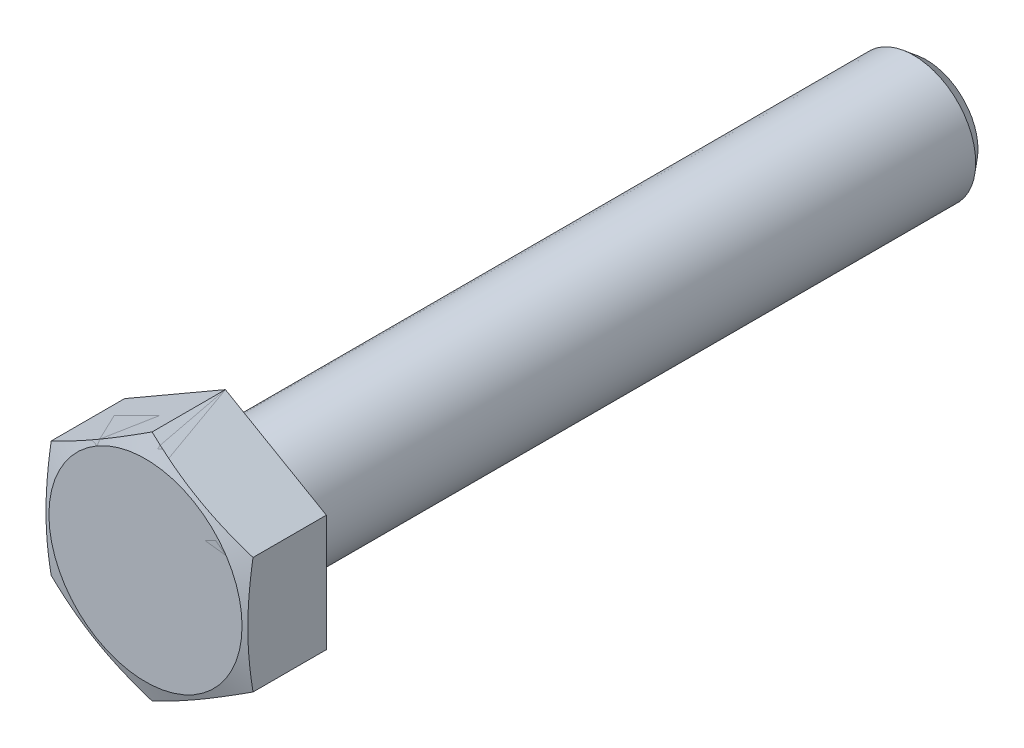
ISO-10303-21;
HEADER;
FILE_DESCRIPTION(('STEP AP214'),'2;1');
FILE_NAME('part.step','',(''),(''),'','','');
FILE_SCHEMA(('AUTOMOTIVE_DESIGN { 1 0 10303 214 1 1 1 1 }'));
ENDSEC;
DATA;
#1=APPLICATION_CONTEXT('core data for automotive mechanical design processes');
#2=APPLICATION_PROTOCOL_DEFINITION('international standard','automotive_design',2000,#1);
#3=PRODUCT_CONTEXT('',#1,'mechanical');
#4=PRODUCT('Part','Part','',(#3));
#5=PRODUCT_RELATED_PRODUCT_CATEGORY('part','',(#4));
#6=PRODUCT_DEFINITION_FORMATION('','',#4);
#7=PRODUCT_DEFINITION_CONTEXT('part definition',#1,'design');
#8=PRODUCT_DEFINITION('design','',#6,#7);
#9=PRODUCT_DEFINITION_SHAPE('','',#8);
#10=(LENGTH_UNIT() NAMED_UNIT(*) SI_UNIT(.MILLI.,.METRE.));
#11=(NAMED_UNIT(*) PLANE_ANGLE_UNIT() SI_UNIT($,.RADIAN.));
#12=(NAMED_UNIT(*) SI_UNIT($,.STERADIAN.) SOLID_ANGLE_UNIT());
#13=UNCERTAINTY_MEASURE_WITH_UNIT(LENGTH_MEASURE(1.E-05),#10,'distance_accuracy_value','');
#14=(GEOMETRIC_REPRESENTATION_CONTEXT(3) GLOBAL_UNCERTAINTY_ASSIGNED_CONTEXT((#13)) GLOBAL_UNIT_ASSIGNED_CONTEXT((#10,
#11,#12)) REPRESENTATION_CONTEXT('',''));
#15=CARTESIAN_POINT('',(0.,0.,0.));
#16=DIRECTION('',(0.,0.,1.));
#17=DIRECTION('',(1.,0.,0.));
#18=AXIS2_PLACEMENT_3D('',#15,#16,#17);
#19=CARTESIAN_POINT('',(0.,0.,0.15));
#20=DIRECTION('',(0.,0.,1.));
#21=DIRECTION('',(1.,0.,0.));
#22=AXIS2_PLACEMENT_3D('',#19,#20,#21);
#23=TOROIDAL_SURFACE('',#22,5.65,0.15);
#24=CARTESIAN_POINT('',(0.,0.,0.15));
#25=DIRECTION('',(0.,0.,1.));
#26=DIRECTION('',(1.,0.,0.));
#27=AXIS2_PLACEMENT_3D('',#24,#25,#26);
#28=CIRCLE('',#27,5.8);
#29=CARTESIAN_POINT('',(5.8,0.,0.15));
#30=VERTEX_POINT('',#29);
#31=EDGE_CURVE('P0_E11',#30,#30,#28,.T.);
#32=ORIENTED_EDGE('',*,*,#31,.F.);
#33=EDGE_LOOP('',(#32));
#34=FACE_BOUND('',#33,.T.);
#35=CARTESIAN_POINT('',(0.,0.,0.));
#36=DIRECTION('',(0.,0.,1.));
#37=DIRECTION('',(1.,0.,0.));
#38=AXIS2_PLACEMENT_3D('',#35,#36,#37);
#39=CIRCLE('',#38,5.65);
#40=CARTESIAN_POINT('',(5.65,0.,0.));
#41=VERTEX_POINT('',#40);
#42=EDGE_CURVE('P0_E33',#41,#41,#39,.T.);
#43=ORIENTED_EDGE('',*,*,#42,.T.);
#44=EDGE_LOOP('',(#43));
#45=FACE_BOUND('',#44,.T.);
#46=ADVANCED_FACE('P0_F26',(#34,#45),#23,.T.);
#47=CARTESIAN_POINT('',(0.,5.65,0.));
#48=DIRECTION('',(0.,0.,-1.));
#49=DIRECTION('',(-1.,0.,0.));
#50=AXIS2_PLACEMENT_3D('',#47,#48,#49);
#51=PLANE('',#50);
#52=CARTESIAN_POINT('',(0.,0.,0.));
#53=DIRECTION('',(0.,0.,1.));
#54=DIRECTION('',(1.,0.,0.));
#55=AXIS2_PLACEMENT_3D('',#52,#53,#54);
#56=CIRCLE('',#55,4.4);
#57=CARTESIAN_POINT('',(4.4,0.,0.));
#58=VERTEX_POINT('',#57);
#59=EDGE_CURVE('P0_E118',#58,#58,#56,.T.);
#60=ORIENTED_EDGE('',*,*,#59,.T.);
#61=EDGE_LOOP('',(#60));
#62=FACE_BOUND('',#61,.T.);
#63=ORIENTED_EDGE('',*,*,#42,.F.);
#64=EDGE_LOOP('',(#63));
#65=FACE_BOUND('',#64,.T.);
#66=ADVANCED_FACE('P0_F124',(#62,#65),#51,.T.);
#67=CARTESIAN_POINT('',(0.,0.,-0.4));
#68=DIRECTION('',(0.,0.,1.));
#69=DIRECTION('',(1.,0.,0.));
#70=AXIS2_PLACEMENT_3D('',#67,#68,#69);
#71=TOROIDAL_SURFACE('',#70,4.4,0.4);
#72=CARTESIAN_POINT('',(0.,0.,-0.4));
#73=DIRECTION('',(0.,0.,1.));
#74=DIRECTION('',(1.,0.,0.));
#75=AXIS2_PLACEMENT_3D('',#72,#73,#74);
#76=CIRCLE('',#75,4.);
#77=CARTESIAN_POINT('',(4.,0.,-0.4));
#78=VERTEX_POINT('',#77);
#79=EDGE_CURVE('P0_E115',#78,#78,#76,.T.);
#80=ORIENTED_EDGE('',*,*,#79,.T.);
#81=EDGE_LOOP('',(#80));
#82=FACE_BOUND('',#81,.T.);
#83=ORIENTED_EDGE('',*,*,#59,.F.);
#84=EDGE_LOOP('',(#83));
#85=FACE_BOUND('',#84,.T.);
#86=ADVANCED_FACE('P0_F126',(#82,#85),#71,.F.);
#87=CARTESIAN_POINT('',(-6.5,-3.752775,0.15));
#88=DIRECTION('',(0.,0.,-1.));
#89=DIRECTION('',(-1.,0.,0.));
#90=AXIS2_PLACEMENT_3D('',#87,#88,#89);
#91=PLANE('',#90);
#92=DIRECTION('',(0.,-1.,0.));
#93=VECTOR('',#92,1.);
#94=CARTESIAN_POINT('',(-6.5,3.752775,0.15));
#95=LINE('',#94,#93);
#96=CARTESIAN_POINT('',(-6.5,3.752775,0.15));
#97=VERTEX_POINT('',#96);
#98=CARTESIAN_POINT('',(-6.5,-3.752775,0.15));
#99=VERTEX_POINT('',#98);
#100=EDGE_CURVE('P0_E92',#97,#99,#95,.T.);
#101=ORIENTED_EDGE('',*,*,#100,.F.);
#102=DIRECTION('',(0.866025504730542,0.499999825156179,0.));
#103=VECTOR('',#102,1.);
#104=CARTESIAN_POINT('',(-6.5,3.752775,0.15));
#105=LINE('',#104,#103);
#106=CARTESIAN_POINT('',(0.,7.50555,0.15));
#107=VERTEX_POINT('',#106);
#108=EDGE_CURVE('P0_E97',#97,#107,#105,.T.);
#109=ORIENTED_EDGE('',*,*,#108,.T.);
#110=DIRECTION('',(0.866025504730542,-0.499999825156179,0.));
#111=VECTOR('',#110,1.);
#112=CARTESIAN_POINT('',(0.,7.50555,0.15));
#113=LINE('',#112,#111);
#114=CARTESIAN_POINT('',(6.5,3.752775,0.15));
#115=VERTEX_POINT('',#114);
#116=EDGE_CURVE('P0_E103',#107,#115,#113,.T.);
#117=ORIENTED_EDGE('',*,*,#116,.T.);
#118=DIRECTION('',(0.,-1.,0.));
#119=VECTOR('',#118,1.);
#120=CARTESIAN_POINT('',(6.5,3.752775,0.15));
#121=LINE('',#120,#119);
#122=CARTESIAN_POINT('',(6.5,-3.752775,0.15));
#123=VERTEX_POINT('',#122);
#124=EDGE_CURVE('P0_E233',#115,#123,#121,.T.);
#125=ORIENTED_EDGE('',*,*,#124,.T.);
#126=DIRECTION('',(-0.866025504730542,-0.499999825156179,0.));
#127=VECTOR('',#126,1.);
#128=CARTESIAN_POINT('',(6.5,-3.752775,0.15));
#129=LINE('',#128,#127);
#130=CARTESIAN_POINT('',(0.,-7.50555,0.15));
#131=VERTEX_POINT('',#130);
#132=EDGE_CURVE('P0_E219',#123,#131,#129,.T.);
#133=ORIENTED_EDGE('',*,*,#132,.T.);
#134=DIRECTION('',(-0.866025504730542,0.499999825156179,0.));
#135=VECTOR('',#134,1.);
#136=CARTESIAN_POINT('',(0.,-7.50555,0.15));
#137=LINE('',#136,#135);
#138=EDGE_CURVE('P0_E217',#131,#99,#137,.T.);
#139=ORIENTED_EDGE('',*,*,#138,.T.);
#140=EDGE_LOOP('',(#101,#109,#117,#125,#133,#139));
#141=FACE_BOUND('',#140,.T.);
#142=ORIENTED_EDGE('',*,*,#31,.T.);
#143=EDGE_LOOP('',(#142));
#144=FACE_BOUND('',#143,.T.);
#145=ADVANCED_FACE('P0_F132',(#141,#144),#91,.T.);
#146=CARTESIAN_POINT('',(-6.5,3.752775,0.15));
#147=DIRECTION('',(-1.,0.,0.));
#148=DIRECTION('',(0.,0.,1.));
#149=AXIS2_PLACEMENT_3D('',#146,#147,#148);
#150=PLANE('',#149);
#151=CARTESIAN_POINT('',(-6.5,-9.92768465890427,3.42219076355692));
#152=CARTESIAN_POINT('',(-6.5,-9.63320200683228,3.50410507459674));
#153=CARTESIAN_POINT('',(-6.5,-9.33844353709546,3.58504584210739));
#154=CARTESIAN_POINT('',(-6.5,-8.74823643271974,3.74444577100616));
#155=CARTESIAN_POINT('',(-6.5,-8.45278775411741,3.82290476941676));
#156=CARTESIAN_POINT('',(-6.5,-7.86064924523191,3.97691306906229));
#157=CARTESIAN_POINT('',(-6.5,-7.56395820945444,4.05245775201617));
#158=CARTESIAN_POINT('',(-6.5,-6.96964246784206,4.19977756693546));
#159=CARTESIAN_POINT('',(-6.5,-6.67201777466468,4.27155274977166));
#160=CARTESIAN_POINT('',(-6.5,-6.07920080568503,4.40958972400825));
#161=CARTESIAN_POINT('',(-6.5,-5.78402145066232,4.47590673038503));
#162=CARTESIAN_POINT('',(-6.5,-5.19244039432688,4.60283348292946));
#163=CARTESIAN_POINT('',(-6.5,-4.89603873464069,4.66344342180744));
#164=CARTESIAN_POINT('',(-6.5,-4.30192301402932,4.77756540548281));
#165=CARTESIAN_POINT('',(-6.5,-4.00420923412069,4.83107890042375));
#166=CARTESIAN_POINT('',(-6.5,-3.4073313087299,4.92939310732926));
#167=CARTESIAN_POINT('',(-6.5,-3.10816717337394,4.9741938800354));
#168=CARTESIAN_POINT('',(-6.5,-2.51584786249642,5.05231938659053));
#169=CARTESIAN_POINT('',(-6.5,-2.22272695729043,5.08590043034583));
#170=CARTESIAN_POINT('',(-6.5,-1.6353790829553,5.14147194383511));
#171=CARTESIAN_POINT('',(-6.5,-1.34115215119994,5.16346280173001));
#172=CARTESIAN_POINT('',(-6.5,-0.752211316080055,5.19459534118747));
#173=CARTESIAN_POINT('',(-6.5,-0.457497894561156,5.20374596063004));
#174=CARTESIAN_POINT('',(-6.5,0.132041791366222,5.20865235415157));
#175=CARTESIAN_POINT('',(-6.5,0.426868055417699,5.20440817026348));
#176=CARTESIAN_POINT('',(-6.5,1.01755930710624,5.18273935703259));
#177=CARTESIAN_POINT('',(-6.5,1.31342173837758,5.16524639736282));
#178=CARTESIAN_POINT('',(-6.5,1.90416213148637,5.11804868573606));
#179=CARTESIAN_POINT('',(-6.5,2.19904006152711,5.08834354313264));
#180=CARTESIAN_POINT('',(-6.5,2.78778899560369,5.01822295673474));
#181=CARTESIAN_POINT('',(-6.5,3.08165875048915,4.97779718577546));
#182=CARTESIAN_POINT('',(-6.5,3.66800309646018,4.88794282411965));
#183=CARTESIAN_POINT('',(-6.5,3.96047768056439,4.83851418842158));
#184=CARTESIAN_POINT('',(-6.5,4.53383951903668,4.734123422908));
#185=CARTESIAN_POINT('',(-6.5,4.81477360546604,4.67941596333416));
#186=CARTESIAN_POINT('',(-6.5,5.37549299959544,4.56437238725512));
#187=CARTESIAN_POINT('',(-6.5,5.65527825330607,4.50403600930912));
#188=CARTESIAN_POINT('',(-6.5,6.21386077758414,4.3787797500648));
#189=CARTESIAN_POINT('',(-6.5,6.49265788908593,4.31385916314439));
#190=CARTESIAN_POINT('',(-6.5,7.0493618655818,4.18029589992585));
#191=CARTESIAN_POINT('',(-6.5,7.3272687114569,4.11165314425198));
#192=CARTESIAN_POINT('',(-6.5,7.88244293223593,3.97129958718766));
#193=CARTESIAN_POINT('',(-6.5,8.159709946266,3.89958736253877));
#194=CARTESIAN_POINT('',(-6.5,8.71358713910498,3.75366585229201));
#195=CARTESIAN_POINT('',(-6.5,8.99019731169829,3.67945654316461));
#196=CARTESIAN_POINT('',(-6.5,9.81912857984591,3.45377511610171));
#197=CARTESIAN_POINT('',(-6.5,10.3706135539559,3.29923331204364));
#198=CARTESIAN_POINT('',(-6.5,11.4645427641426,2.98659237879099));
#199=CARTESIAN_POINT('',(-6.5,12.0070088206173,2.82856906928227));
#200=CARTESIAN_POINT('',(-6.5,13.090775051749,2.5085206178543));
#201=CARTESIAN_POINT('',(-6.5,13.6320751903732,2.34649535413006));
#202=CARTESIAN_POINT('',(-6.5,14.7126438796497,2.01984553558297));
#203=CARTESIAN_POINT('',(-6.5,15.2519143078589,1.85522717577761));
#204=CARTESIAN_POINT('',(-6.5,16.3297306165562,1.52373570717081));
#205=CARTESIAN_POINT('',(-6.5,16.8682765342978,1.3568627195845));
#206=CARTESIAN_POINT('',(-6.5,17.4065709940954,1.18919184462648));
#207=B_SPLINE_CURVE_WITH_KNOTS('',3,(#151,#152,#153,#154,#155,#156,#157,#158,#159,#160,#161,
#162,#163,#164,#165,#166,#167,#168,#169,#170,#171,#172,#173,#174,#175,#176,#177,#178,#179,#180,
#181,#182,#183,#184,#185,#186,#187,#188,#189,#190,#191,#192,#193,#194,#195,#196,#197,#198,#199,
#200,#201,#202,#203,#204,#205,#206),.UNSPECIFIED.,.F.,.F.,(4,2,2,2,2,2,2,2,2,2,2,2,2,2,2,2,2,2,
2,2,2,2,2,2,2,2,2,4),(0.,0.916995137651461,1.83405036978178,2.75250368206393,3.67094459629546,
4.57851158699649,5.48604792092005,6.39339851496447,7.30074278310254,8.18565759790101,
9.07054277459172,9.95481169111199,10.8390778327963,11.7279358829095,12.616822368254,
13.5065682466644,14.3963185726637,15.2548833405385,16.1134880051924,16.9722251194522,
17.830980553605,18.6901385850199,19.5493047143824,21.2674414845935,22.9624656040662,
24.6575413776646,26.3490461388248,28.0404603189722),.UNSPECIFIED.);
#208=CARTESIAN_POINT('',(-6.5,3.752775,4.87245657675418));
#209=VERTEX_POINT('',#208);
#210=CARTESIAN_POINT('',(-6.5,-3.752775,4.87245657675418));
#211=VERTEX_POINT('',#210);
#212=EDGE_CURVE('P0_E81',#209,#211,#207,.F.);
#213=ORIENTED_EDGE('',*,*,#212,.F.);
#214=DIRECTION('',(0.,0.,1.));
#215=VECTOR('',#214,1.);
#216=CARTESIAN_POINT('',(-6.5,3.752775,0.15));
#217=LINE('',#216,#215);
#218=EDGE_CURVE('P0_E90',#97,#209,#217,.T.);
#219=ORIENTED_EDGE('',*,*,#218,.F.);
#220=ORIENTED_EDGE('',*,*,#100,.T.);
#221=DIRECTION('',(0.,0.,1.));
#222=VECTOR('',#221,1.);
#223=CARTESIAN_POINT('',(-6.5,-3.752775,0.15));
#224=LINE('',#223,#222);
#225=EDGE_CURVE('P0_E48',#99,#211,#224,.T.);
#226=ORIENTED_EDGE('',*,*,#225,.T.);
#227=EDGE_LOOP('',(#213,#219,#220,#226));
#228=FACE_BOUND('',#227,.T.);
#229=ADVANCED_FACE('P0_F88',(#228),#150,.T.);
#230=CARTESIAN_POINT('',(0.,-7.50555,0.15));
#231=DIRECTION('',(0.499999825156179,0.866025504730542,0.));
#232=DIRECTION('',(0.866025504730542,-0.499999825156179,0.));
#233=AXIS2_PLACEMENT_3D('',#230,#231,#232);
#234=PLANE('',#233);
#235=DIRECTION('',(0.,0.,1.));
#236=VECTOR('',#235,1.);
#237=CARTESIAN_POINT('',(0.,-7.50555,0.15));
#238=LINE('',#237,#236);
#239=CARTESIAN_POINT('',(0.,-7.50555,4.87245744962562));
#240=VERTEX_POINT('',#239);
#241=EDGE_CURVE('P0_E224',#131,#240,#238,.T.);
#242=ORIENTED_EDGE('',*,*,#241,.T.);
#243=CARTESIAN_POINT('',(2.00000000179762E-07,-7.50555011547,4.87245741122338));
#244=CARTESIAN_POINT('',(-0.269447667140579,-7.34998438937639,4.92421240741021));
#245=CARTESIAN_POINT('',(-0.539641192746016,-7.19398815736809,4.97125826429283));
#246=CARTESIAN_POINT('',(-1.08149605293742,-6.88114825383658,5.05398662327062));
#247=CARTESIAN_POINT('',(-1.35315821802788,-6.7243041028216,5.0896618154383));
#248=CARTESIAN_POINT('',(-1.89542621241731,-6.41122567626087,5.14740289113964));
#249=CARTESIAN_POINT('',(-2.16602338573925,-6.25499639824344,5.16957424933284));
#250=CARTESIAN_POINT('',(-2.7077471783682,-5.94223216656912,5.19930920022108));
#251=CARTESIAN_POINT('',(-2.97887360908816,-5.78569732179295,5.20687728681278));
#252=CARTESIAN_POINT('',(-3.52112646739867,-5.47262763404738,5.2068772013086));
#253=CARTESIAN_POINT('',(-3.79225289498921,-5.31609279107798,5.19930902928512));
#254=CARTESIAN_POINT('',(-4.33397667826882,-5.00332856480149,5.16957391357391));
#255=CARTESIAN_POINT('',(-4.60457384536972,-4.84709929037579,5.14740247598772));
#256=CARTESIAN_POINT('',(-5.14684182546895,-4.5340208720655,5.08966125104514));
#257=CARTESIAN_POINT('',(-5.41850398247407,-4.37717672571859,5.05398598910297));
#258=CARTESIAN_POINT('',(-5.96035882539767,-4.06433683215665,4.97125750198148));
#259=CARTESIAN_POINT('',(-6.23055234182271,-3.90834060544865,4.92421158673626));
#260=CARTESIAN_POINT('',(-6.5000002,-3.75277488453,4.87245653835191));
#261=B_SPLINE_CURVE_WITH_KNOTS('',3,(#243,#244,#245,#246,#247,#248,#249,#250,#251,#252,#253,
#254,#255,#256,#257,#258,#259,#260),.UNSPECIFIED.,.F.,.F.,(4,2,2,2,2,2,2,2,4),(0.,
0.946299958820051,1.89320704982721,2.83261995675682,3.7717437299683,4.71086749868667,
5.65028040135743,6.59718748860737,7.54348744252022),.UNSPECIFIED.);
#262=EDGE_CURVE('P0_E93',#240,#211,#261,.T.);
#263=ORIENTED_EDGE('',*,*,#262,.T.);
#264=ORIENTED_EDGE('',*,*,#225,.F.);
#265=ORIENTED_EDGE('',*,*,#138,.F.);
#266=EDGE_LOOP('',(#242,#263,#264,#265));
#267=FACE_BOUND('',#266,.T.);
#268=ADVANCED_FACE('P0_F153',(#267),#234,.F.);
#269=CARTESIAN_POINT('',(6.5,-3.752775,0.15));
#270=DIRECTION('',(-0.499999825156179,0.866025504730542,0.));
#271=DIRECTION('',(0.866025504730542,0.499999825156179,0.));
#272=AXIS2_PLACEMENT_3D('',#269,#270,#271);
#273=PLANE('',#272);
#274=DIRECTION('',(0.,0.,1.));
#275=VECTOR('',#274,1.);
#276=CARTESIAN_POINT('',(6.5,-3.752775,0.15));
#277=LINE('',#276,#275);
#278=CARTESIAN_POINT('',(6.5,-3.752775,4.87245657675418));
#279=VERTEX_POINT('',#278);
#280=EDGE_CURVE('P0_E227',#123,#279,#277,.T.);
#281=ORIENTED_EDGE('',*,*,#280,.T.);
#282=CARTESIAN_POINT('',(6.5000002,-3.75277488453,4.87245653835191));
#283=CARTESIAN_POINT('',(6.23055234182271,-3.90834060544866,4.92421158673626));
#284=CARTESIAN_POINT('',(5.96035882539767,-4.06433683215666,4.97125750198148));
#285=CARTESIAN_POINT('',(5.41850398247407,-4.37717672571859,5.05398598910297));
#286=CARTESIAN_POINT('',(5.14684182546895,-4.5340208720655,5.08966125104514));
#287=CARTESIAN_POINT('',(4.60457384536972,-4.84709929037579,5.14740247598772));
#288=CARTESIAN_POINT('',(4.33397667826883,-5.00332856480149,5.16957391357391));
#289=CARTESIAN_POINT('',(3.79225289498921,-5.31609279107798,5.19930902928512));
#290=CARTESIAN_POINT('',(3.52112646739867,-5.47262763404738,5.20687720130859));
#291=CARTESIAN_POINT('',(2.97887360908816,-5.78569732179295,5.20687728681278));
#292=CARTESIAN_POINT('',(2.7077471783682,-5.94223216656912,5.19930920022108));
#293=CARTESIAN_POINT('',(2.16602338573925,-6.25499639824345,5.16957424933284));
#294=CARTESIAN_POINT('',(1.89542621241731,-6.41122567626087,5.14740289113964));
#295=CARTESIAN_POINT('',(1.35315821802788,-6.72430410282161,5.0896618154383));
#296=CARTESIAN_POINT('',(1.08149605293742,-6.88114825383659,5.05398662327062));
#297=CARTESIAN_POINT('',(0.539641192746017,-7.19398815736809,4.97125826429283));
#298=CARTESIAN_POINT('',(0.269447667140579,-7.34998438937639,4.92421240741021));
#299=CARTESIAN_POINT('',(-2.00000001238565E-07,-7.50555011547,4.87245741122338));
#300=B_SPLINE_CURVE_WITH_KNOTS('',3,(#282,#283,#284,#285,#286,#287,#288,#289,#290,#291,#292,
#293,#294,#295,#296,#297,#298,#299),.UNSPECIFIED.,.F.,.F.,(4,2,2,2,2,2,2,2,4),(0.,
0.94629995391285,1.89320704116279,2.83261994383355,3.77174371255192,4.7108674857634,
5.65028039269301,6.59718748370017,7.54348744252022),.UNSPECIFIED.);
#301=EDGE_CURVE('P0_E190',#279,#240,#300,.T.);
#302=ORIENTED_EDGE('',*,*,#301,.T.);
#303=ORIENTED_EDGE('',*,*,#241,.F.);
#304=ORIENTED_EDGE('',*,*,#132,.F.);
#305=EDGE_LOOP('',(#281,#302,#303,#304));
#306=FACE_BOUND('',#305,.T.);
#307=ADVANCED_FACE('P0_F195',(#306),#273,.F.);
#308=CARTESIAN_POINT('',(6.5,3.752775,0.15));
#309=DIRECTION('',(-1.,0.,0.));
#310=DIRECTION('',(0.,0.,1.));
#311=AXIS2_PLACEMENT_3D('',#308,#309,#310);
#312=PLANE('',#311);
#313=DIRECTION('',(0.,0.,1.));
#314=VECTOR('',#313,1.);
#315=CARTESIAN_POINT('',(6.5,3.752775,0.15));
#316=LINE('',#315,#314);
#317=CARTESIAN_POINT('',(6.5,3.752775,4.87245657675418));
#318=VERTEX_POINT('',#317);
#319=EDGE_CURVE('P0_E101',#115,#318,#316,.T.);
#320=ORIENTED_EDGE('',*,*,#319,.T.);
#321=CARTESIAN_POINT('',(6.5,-9.92768465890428,3.42219076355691));
#322=CARTESIAN_POINT('',(6.5,-9.63320200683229,3.50410507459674));
#323=CARTESIAN_POINT('',(6.5,-9.33844353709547,3.58504584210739));
#324=CARTESIAN_POINT('',(6.5,-8.74823643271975,3.74444577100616));
#325=CARTESIAN_POINT('',(6.5,-8.45278775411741,3.82290476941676));
#326=CARTESIAN_POINT('',(6.5,-7.86064924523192,3.97691306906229));
#327=CARTESIAN_POINT('',(6.5,-7.56395820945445,4.05245775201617));
#328=CARTESIAN_POINT('',(6.5,-6.96964246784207,4.19977756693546));
#329=CARTESIAN_POINT('',(6.5,-6.67201777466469,4.27155274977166));
#330=CARTESIAN_POINT('',(6.5,-6.07920080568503,4.40958972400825));
#331=CARTESIAN_POINT('',(6.5,-5.78402145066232,4.47590673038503));
#332=CARTESIAN_POINT('',(6.5,-5.19244039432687,4.60283348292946));
#333=CARTESIAN_POINT('',(6.5,-4.89603873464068,4.66344342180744));
#334=CARTESIAN_POINT('',(6.5,-4.30192301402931,4.77756540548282));
#335=CARTESIAN_POINT('',(6.5,-4.00420923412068,4.83107890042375));
#336=CARTESIAN_POINT('',(6.5,-3.4073313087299,4.92939310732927));
#337=CARTESIAN_POINT('',(6.5,-3.10816717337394,4.97419388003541));
#338=CARTESIAN_POINT('',(6.5,-2.51584786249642,5.05231938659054));
#339=CARTESIAN_POINT('',(6.5,-2.22272695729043,5.08590043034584));
#340=CARTESIAN_POINT('',(6.5,-1.6353790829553,5.14147194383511));
#341=CARTESIAN_POINT('',(6.5,-1.34115215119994,5.16346280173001));
#342=CARTESIAN_POINT('',(6.5,-0.752211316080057,5.19459534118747));
#343=CARTESIAN_POINT('',(6.5,-0.457497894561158,5.20374596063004));
#344=CARTESIAN_POINT('',(6.5,0.132041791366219,5.20865235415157));
#345=CARTESIAN_POINT('',(6.5,0.426868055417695,5.20440817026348));
#346=CARTESIAN_POINT('',(6.5,1.01755930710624,5.18273935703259));
#347=CARTESIAN_POINT('',(6.5,1.31342173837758,5.16524639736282));
#348=CARTESIAN_POINT('',(6.5,1.90416213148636,5.11804868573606));
#349=CARTESIAN_POINT('',(6.5,2.19904006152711,5.08834354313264));
#350=CARTESIAN_POINT('',(6.5,2.78778899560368,5.01822295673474));
#351=CARTESIAN_POINT('',(6.5,3.08165875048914,4.97779718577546));
#352=CARTESIAN_POINT('',(6.5,3.66800309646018,4.88794282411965));
#353=CARTESIAN_POINT('',(6.5,3.96047768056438,4.83851418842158));
#354=CARTESIAN_POINT('',(6.5,4.53383951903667,4.734123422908));
#355=CARTESIAN_POINT('',(6.5,4.81477360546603,4.67941596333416));
#356=CARTESIAN_POINT('',(6.5,5.37549299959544,4.56437238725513));
#357=CARTESIAN_POINT('',(6.5,5.65527825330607,4.50403600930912));
#358=CARTESIAN_POINT('',(6.5,6.21386077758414,4.3787797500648));
#359=CARTESIAN_POINT('',(6.5,6.49265788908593,4.31385916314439));
#360=CARTESIAN_POINT('',(6.5,7.0493618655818,4.18029589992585));
#361=CARTESIAN_POINT('',(6.5,7.3272687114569,4.11165314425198));
#362=CARTESIAN_POINT('',(6.5,7.88244293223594,3.97129958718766));
#363=CARTESIAN_POINT('',(6.5,8.15970994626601,3.89958736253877));
#364=CARTESIAN_POINT('',(6.5,8.71358713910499,3.75366585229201));
#365=CARTESIAN_POINT('',(6.5,8.9901973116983,3.67945654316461));
#366=CARTESIAN_POINT('',(6.5,9.81912857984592,3.45377511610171));
#367=CARTESIAN_POINT('',(6.5,10.3706135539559,3.29923331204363));
#368=CARTESIAN_POINT('',(6.5,11.4645427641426,2.98659237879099));
#369=CARTESIAN_POINT('',(6.5,12.0070088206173,2.82856906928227));
#370=CARTESIAN_POINT('',(6.5,13.090775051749,2.5085206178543));
#371=CARTESIAN_POINT('',(6.5,13.6320751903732,2.34649535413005));
#372=CARTESIAN_POINT('',(6.5,14.7126438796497,2.01984553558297));
#373=CARTESIAN_POINT('',(6.5,15.2519143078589,1.85522717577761));
#374=CARTESIAN_POINT('',(6.5,16.3297306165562,1.52373570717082));
#375=CARTESIAN_POINT('',(6.5,16.8682765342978,1.3568627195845));
#376=CARTESIAN_POINT('',(6.5,17.4065709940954,1.18919184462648));
#377=B_SPLINE_CURVE_WITH_KNOTS('',3,(#321,#322,#323,#324,#325,#326,#327,#328,#329,#330,#331,
#332,#333,#334,#335,#336,#337,#338,#339,#340,#341,#342,#343,#344,#345,#346,#347,#348,#349,#350,
#351,#352,#353,#354,#355,#356,#357,#358,#359,#360,#361,#362,#363,#364,#365,#366,#367,#368,#369,
#370,#371,#372,#373,#374,#375,#376),.UNSPECIFIED.,.F.,.F.,(4,2,2,2,2,2,2,2,2,2,2,2,2,2,2,2,2,2,
2,2,2,2,2,2,2,2,2,4),(0.,0.916995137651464,1.83405036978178,2.75250368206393,3.67094459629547,
4.57851158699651,5.48604792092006,6.39339851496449,7.30074278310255,8.18565759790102,
9.07054277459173,9.954811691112,10.8390778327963,11.7279358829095,12.616822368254,
13.5065682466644,14.3963185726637,15.2548833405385,16.1134880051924,16.9722251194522,
17.830980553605,18.6901385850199,19.5493047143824,21.2674414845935,22.9624656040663,
24.6575413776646,26.3490461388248,28.0404603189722),.UNSPECIFIED.);
#378=EDGE_CURVE('P0_E185',#318,#279,#377,.F.);
#379=ORIENTED_EDGE('',*,*,#378,.T.);
#380=ORIENTED_EDGE('',*,*,#280,.F.);
#381=ORIENTED_EDGE('',*,*,#124,.F.);
#382=EDGE_LOOP('',(#320,#379,#380,#381));
#383=FACE_BOUND('',#382,.T.);
#384=ADVANCED_FACE('P0_F198',(#383),#312,.F.);
#385=CARTESIAN_POINT('',(0.,7.50555,0.15));
#386=DIRECTION('',(-0.499999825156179,-0.866025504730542,0.));
#387=DIRECTION('',(-0.866025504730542,0.499999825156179,0.));
#388=AXIS2_PLACEMENT_3D('',#385,#386,#387);
#389=PLANE('',#388);
#390=DIRECTION('',(0.,0.,1.));
#391=VECTOR('',#390,1.);
#392=CARTESIAN_POINT('',(0.,7.50555,0.15));
#393=LINE('',#392,#391);
#394=CARTESIAN_POINT('',(0.,7.50555,4.87245744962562));
#395=VERTEX_POINT('',#394);
#396=EDGE_CURVE('P0_E99',#107,#395,#393,.T.);
#397=ORIENTED_EDGE('',*,*,#396,.T.);
#398=CARTESIAN_POINT('',(-1.99999999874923E-07,7.50555011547,4.87245741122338));
#399=CARTESIAN_POINT('',(0.269447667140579,7.34998438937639,4.92421240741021));
#400=CARTESIAN_POINT('',(0.539641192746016,7.19398815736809,4.97125826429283));
#401=CARTESIAN_POINT('',(1.08149605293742,6.88114825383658,5.05398662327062));
#402=CARTESIAN_POINT('',(1.35315821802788,6.7243041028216,5.0896618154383));
#403=CARTESIAN_POINT('',(1.89542621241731,6.41122567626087,5.14740289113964));
#404=CARTESIAN_POINT('',(2.16602338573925,6.25499639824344,5.16957424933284));
#405=CARTESIAN_POINT('',(2.7077471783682,5.94223216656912,5.19930920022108));
#406=CARTESIAN_POINT('',(2.97887360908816,5.78569732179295,5.20687728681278));
#407=CARTESIAN_POINT('',(3.52112646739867,5.47262763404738,5.2068772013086));
#408=CARTESIAN_POINT('',(3.79225289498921,5.31609279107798,5.19930902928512));
#409=CARTESIAN_POINT('',(4.33397667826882,5.00332856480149,5.16957391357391));
#410=CARTESIAN_POINT('',(4.60457384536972,4.84709929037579,5.14740247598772));
#411=CARTESIAN_POINT('',(5.14684182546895,4.5340208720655,5.08966125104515));
#412=CARTESIAN_POINT('',(5.41850398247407,4.37717672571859,5.05398598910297));
#413=CARTESIAN_POINT('',(5.96035882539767,4.06433683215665,4.97125750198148));
#414=CARTESIAN_POINT('',(6.23055234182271,3.90834060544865,4.92421158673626));
#415=CARTESIAN_POINT('',(6.5000002,3.75277488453,4.87245653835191));
#416=B_SPLINE_CURVE_WITH_KNOTS('',3,(#398,#399,#400,#401,#402,#403,#404,#405,#406,#407,#408,
#409,#410,#411,#412,#413,#414,#415),.UNSPECIFIED.,.F.,.F.,(4,2,2,2,2,2,2,2,4),(0.,
0.946299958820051,1.89320704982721,2.83261995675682,3.7717437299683,4.71086749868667,
5.65028040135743,6.59718748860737,7.54348744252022),.UNSPECIFIED.);
#417=EDGE_CURVE('P0_E40',#395,#318,#416,.T.);
#418=ORIENTED_EDGE('',*,*,#417,.T.);
#419=ORIENTED_EDGE('',*,*,#319,.F.);
#420=ORIENTED_EDGE('',*,*,#116,.F.);
#421=EDGE_LOOP('',(#397,#418,#419,#420));
#422=FACE_BOUND('',#421,.T.);
#423=ADVANCED_FACE('P0_F202',(#422),#389,.F.);
#424=CARTESIAN_POINT('',(-6.5,3.752775,0.15));
#425=DIRECTION('',(0.499999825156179,-0.866025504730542,0.));
#426=DIRECTION('',(-0.866025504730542,-0.499999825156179,0.));
#427=AXIS2_PLACEMENT_3D('',#424,#425,#426);
#428=PLANE('',#427);
#429=ORIENTED_EDGE('',*,*,#218,.T.);
#430=CARTESIAN_POINT('',(-6.5000002,3.75277488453,4.8724565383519));
#431=CARTESIAN_POINT('',(-6.23055234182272,3.90834060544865,4.92421158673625));
#432=CARTESIAN_POINT('',(-5.96035882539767,4.06433683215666,4.97125750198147));
#433=CARTESIAN_POINT('',(-5.41850398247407,4.37717672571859,5.05398598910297));
#434=CARTESIAN_POINT('',(-5.14684182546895,4.5340208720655,5.08966125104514));
#435=CARTESIAN_POINT('',(-4.60457384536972,4.84709929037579,5.14740247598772));
#436=CARTESIAN_POINT('',(-4.33397667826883,5.00332856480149,5.16957391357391));
#437=CARTESIAN_POINT('',(-3.79225289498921,5.31609279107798,5.19930902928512));
#438=CARTESIAN_POINT('',(-3.52112646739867,5.47262763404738,5.20687720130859));
#439=CARTESIAN_POINT('',(-2.97887360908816,5.78569732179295,5.20687728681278));
#440=CARTESIAN_POINT('',(-2.7077471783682,5.94223216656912,5.19930920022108));
#441=CARTESIAN_POINT('',(-2.16602338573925,6.25499639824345,5.16957424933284));
#442=CARTESIAN_POINT('',(-1.89542621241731,6.41122567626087,5.14740289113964));
#443=CARTESIAN_POINT('',(-1.35315821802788,6.72430410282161,5.0896618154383));
#444=CARTESIAN_POINT('',(-1.08149605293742,6.88114825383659,5.05398662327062));
#445=CARTESIAN_POINT('',(-0.539641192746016,7.19398815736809,4.97125826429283));
#446=CARTESIAN_POINT('',(-0.269447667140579,7.34998438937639,4.92421240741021));
#447=CARTESIAN_POINT('',(2.00000001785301E-07,7.50555011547,4.87245741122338));
#448=B_SPLINE_CURVE_WITH_KNOTS('',3,(#430,#431,#432,#433,#434,#435,#436,#437,#438,#439,#440,
#441,#442,#443,#444,#445,#446,#447),.UNSPECIFIED.,.F.,.F.,(4,2,2,2,2,2,2,2,4),(0.,
0.946299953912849,1.89320704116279,2.83261994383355,3.77174371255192,4.7108674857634,
5.65028039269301,6.59718748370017,7.54348744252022),.UNSPECIFIED.);
#449=EDGE_CURVE('P0_E77',#209,#395,#448,.T.);
#450=ORIENTED_EDGE('',*,*,#449,.T.);
#451=ORIENTED_EDGE('',*,*,#396,.F.);
#452=ORIENTED_EDGE('',*,*,#108,.F.);
#453=EDGE_LOOP('',(#429,#450,#451,#452));
#454=FACE_BOUND('',#453,.T.);
#455=ADVANCED_FACE('P0_F95',(#454),#428,.F.);
#456=CARTESIAN_POINT('',(0.,0.,4.82253454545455));
#457=DIRECTION('',(0.,0.,-1.));
#458=DIRECTION('',(-1.,0.,0.));
#459=AXIS2_PLACEMENT_3D('',#456,#457,#458);
#460=CONICAL_SURFACE('',#459,7.655661,1.24972999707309);
#461=ORIENTED_EDGE('',*,*,#212,.T.);
#462=ORIENTED_EDGE('',*,*,#262,.F.);
#463=ORIENTED_EDGE('',*,*,#301,.F.);
#464=ORIENTED_EDGE('',*,*,#378,.F.);
#465=ORIENTED_EDGE('',*,*,#417,.F.);
#466=ORIENTED_EDGE('',*,*,#449,.F.);
#467=EDGE_LOOP('',(#461,#462,#463,#464,#465,#466));
#468=FACE_BOUND('',#467,.T.);
#469=CARTESIAN_POINT('',(0.,0.,5.3));
#470=DIRECTION('',(0.,0.,-1.));
#471=DIRECTION('',(-1.,0.,0.));
#472=AXIS2_PLACEMENT_3D('',#469,#470,#471);
#473=CIRCLE('',#472,6.21999097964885);
#474=CARTESIAN_POINT('',(-6.21999097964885,0.,5.3));
#475=VERTEX_POINT('',#474);
#476=EDGE_CURVE('P0_E85',#475,#475,#473,.F.);
#477=ORIENTED_EDGE('',*,*,#476,.F.);
#478=EDGE_LOOP('',(#477));
#479=FACE_BOUND('',#478,.T.);
#480=ADVANCED_FACE('P0_F79',(#468,#479),#460,.T.);
#481=CARTESIAN_POINT('',(-6.5,-3.752775,5.3));
#482=DIRECTION('',(0.,0.,-1.));
#483=DIRECTION('',(-1.,0.,0.));
#484=AXIS2_PLACEMENT_3D('',#481,#482,#483);
#485=PLANE('',#484);
#486=ORIENTED_EDGE('',*,*,#476,.T.);
#487=EDGE_LOOP('',(#486));
#488=FACE_BOUND('',#487,.T.);
#489=ADVANCED_FACE('P0_F148',(#488),#485,.F.);
#490=CARTESIAN_POINT('',(0.,3.3234375,-45.));
#491=DIRECTION('',(0.,0.,-1.));
#492=DIRECTION('',(-1.,0.,0.));
#493=AXIS2_PLACEMENT_3D('',#490,#491,#492);
#494=PLANE('',#493);
#495=CARTESIAN_POINT('',(0.,0.,-45.));
#496=DIRECTION('',(0.,0.,1.));
#497=DIRECTION('',(1.,0.,0.));
#498=AXIS2_PLACEMENT_3D('',#495,#496,#497);
#499=CIRCLE('',#498,3.3234375);
#500=CARTESIAN_POINT('',(3.3234375,0.,-45.));
#501=VERTEX_POINT('',#500);
#502=EDGE_CURVE('P0_E109',#501,#501,#499,.T.);
#503=ORIENTED_EDGE('',*,*,#502,.F.);
#504=EDGE_LOOP('',(#503));
#505=FACE_BOUND('',#504,.T.);
#506=ADVANCED_FACE('P0_F144',(#505),#494,.T.);
#507=CARTESIAN_POINT('',(0.,0.,-44.1734375));
#508=DIRECTION('',(0.,0.,1.));
#509=DIRECTION('',(1.,0.,0.));
#510=AXIS2_PLACEMENT_3D('',#507,#508,#509);
#511=CONICAL_SURFACE('',#510,4.,0.68593535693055);
#512=ORIENTED_EDGE('',*,*,#502,.T.);
#513=EDGE_LOOP('',(#512));
#514=FACE_BOUND('',#513,.T.);
#515=CARTESIAN_POINT('',(0.,0.,-44.1734375));
#516=DIRECTION('',(0.,0.,1.));
#517=DIRECTION('',(1.,0.,0.));
#518=AXIS2_PLACEMENT_3D('',#515,#516,#517);
#519=CIRCLE('',#518,4.);
#520=CARTESIAN_POINT('',(4.,0.,-44.1734375));
#521=VERTEX_POINT('',#520);
#522=EDGE_CURVE('P0_E112',#521,#521,#519,.T.);
#523=ORIENTED_EDGE('',*,*,#522,.F.);
#524=EDGE_LOOP('',(#523));
#525=FACE_BOUND('',#524,.T.);
#526=ADVANCED_FACE('P0_F140',(#514,#525),#511,.T.);
#527=CARTESIAN_POINT('',(0.,0.,0.15));
#528=DIRECTION('',(0.,0.,1.));
#529=DIRECTION('',(1.,0.,0.));
#530=AXIS2_PLACEMENT_3D('',#527,#528,#529);
#531=CYLINDRICAL_SURFACE('',#530,4.);
#532=ORIENTED_EDGE('',*,*,#522,.T.);
#533=EDGE_LOOP('',(#532));
#534=FACE_BOUND('',#533,.T.);
#535=ORIENTED_EDGE('',*,*,#79,.F.);
#536=EDGE_LOOP('',(#535));
#537=FACE_BOUND('',#536,.T.);
#538=ADVANCED_FACE('P0_F137',(#534,#537),#531,.T.);
#539=CLOSED_SHELL('',(#46,#66,#86,#145,#229,#268,#307,#384,#423,#455,#480,#489,#506,#526,#538));
#540=MANIFOLD_SOLID_BREP('P0_B2',#539);
#541=CARTESIAN_POINT('',(0.,0.,0.15));
#542=DIRECTION('',(0.,0.,1.));
#543=DIRECTION('',(1.,0.,0.));
#544=AXIS2_PLACEMENT_3D('',#541,#542,#543);
#545=TOROIDAL_SURFACE('',#544,5.65,0.15);
#546=CARTESIAN_POINT('',(0.,0.,0.15));
#547=DIRECTION('',(0.,0.,1.));
#548=DIRECTION('',(1.,0.,0.));
#549=AXIS2_PLACEMENT_3D('',#546,#547,#548);
#550=CIRCLE('',#549,5.8);
#551=CARTESIAN_POINT('',(5.8,0.,0.15));
#552=VERTEX_POINT('',#551);
#553=EDGE_CURVE('P1_E11',#552,#552,#550,.T.);
#554=ORIENTED_EDGE('',*,*,#553,.F.);
#555=EDGE_LOOP('',(#554));
#556=FACE_BOUND('',#555,.T.);
#557=CARTESIAN_POINT('',(0.,0.,0.));
#558=DIRECTION('',(0.,0.,1.));
#559=DIRECTION('',(1.,0.,0.));
#560=AXIS2_PLACEMENT_3D('',#557,#558,#559);
#561=CIRCLE('',#560,5.65);
#562=CARTESIAN_POINT('',(5.65,0.,0.));
#563=VERTEX_POINT('',#562);
#564=EDGE_CURVE('P1_E23',#563,#563,#561,.T.);
#565=ORIENTED_EDGE('',*,*,#564,.T.);
#566=EDGE_LOOP('',(#565));
#567=FACE_BOUND('',#566,.T.);
#568=ADVANCED_FACE('P1_F16',(#556,#567),#545,.T.);
#569=CARTESIAN_POINT('',(0.,5.65,0.));
#570=DIRECTION('',(0.,0.,-1.));
#571=DIRECTION('',(-1.,0.,0.));
#572=AXIS2_PLACEMENT_3D('',#569,#570,#571);
#573=PLANE('',#572);
#574=CARTESIAN_POINT('',(0.,0.,0.));
#575=DIRECTION('',(0.,0.,1.));
#576=DIRECTION('',(1.,0.,0.));
#577=AXIS2_PLACEMENT_3D('',#574,#575,#576);
#578=CIRCLE('',#577,4.4);
#579=CARTESIAN_POINT('',(4.4,0.,0.));
#580=VERTEX_POINT('',#579);
#581=EDGE_CURVE('P1_E117',#580,#580,#578,.T.);
#582=ORIENTED_EDGE('',*,*,#581,.T.);
#583=EDGE_LOOP('',(#582));
#584=FACE_BOUND('',#583,.T.);
#585=ORIENTED_EDGE('',*,*,#564,.F.);
#586=EDGE_LOOP('',(#585));
#587=FACE_BOUND('',#586,.T.);
#588=ADVANCED_FACE('P1_F123',(#584,#587),#573,.T.);
#589=CARTESIAN_POINT('',(0.,0.,-0.4));
#590=DIRECTION('',(0.,0.,1.));
#591=DIRECTION('',(1.,0.,0.));
#592=AXIS2_PLACEMENT_3D('',#589,#590,#591);
#593=TOROIDAL_SURFACE('',#592,4.4,0.4);
#594=CARTESIAN_POINT('',(0.,0.,-0.4));
#595=DIRECTION('',(0.,0.,1.));
#596=DIRECTION('',(1.,0.,0.));
#597=AXIS2_PLACEMENT_3D('',#594,#595,#596);
#598=CIRCLE('',#597,4.);
#599=CARTESIAN_POINT('',(4.,0.,-0.4));
#600=VERTEX_POINT('',#599);
#601=EDGE_CURVE('P1_E114',#600,#600,#598,.T.);
#602=ORIENTED_EDGE('',*,*,#601,.T.);
#603=EDGE_LOOP('',(#602));
#604=FACE_BOUND('',#603,.T.);
#605=ORIENTED_EDGE('',*,*,#581,.F.);
#606=EDGE_LOOP('',(#605));
#607=FACE_BOUND('',#606,.T.);
#608=ADVANCED_FACE('P1_F125',(#604,#607),#593,.F.);
#609=CARTESIAN_POINT('',(0.,0.,0.15));
#610=DIRECTION('',(0.,0.,1.));
#611=DIRECTION('',(1.,0.,0.));
#612=AXIS2_PLACEMENT_3D('',#609,#610,#611);
#613=CYLINDRICAL_SURFACE('',#612,4.);
#614=CARTESIAN_POINT('',(0.,0.,-1.37215937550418));
#615=DIRECTION('',(0.,0.,1.));
#616=DIRECTION('',(1.,0.,0.));
#617=AXIS2_PLACEMENT_3D('',#614,#615,#616);
#618=CIRCLE('',#617,4.);
#619=CARTESIAN_POINT('',(4.,0.,-1.37215937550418));
#620=VERTEX_POINT('',#619);
#621=EDGE_CURVE('P1_E111',#620,#620,#618,.T.);
#622=ORIENTED_EDGE('',*,*,#621,.T.);
#623=EDGE_LOOP('',(#622));
#624=FACE_BOUND('',#623,.T.);
#625=ORIENTED_EDGE('',*,*,#601,.F.);
#626=EDGE_LOOP('',(#625));
#627=FACE_BOUND('',#626,.T.);
#628=ADVANCED_FACE('P1_F132',(#624,#627),#613,.T.);
#629=CARTESIAN_POINT('',(0.,0.,-1.37215937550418));
#630=DIRECTION('',(0.,0.,1.));
#631=DIRECTION('',(1.,0.,0.));
#632=AXIS2_PLACEMENT_3D('',#629,#630,#631);
#633=CONICAL_SURFACE('',#632,4.,0.523598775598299);
#634=CARTESIAN_POINT('',(0.,0.,-2.544));
#635=DIRECTION('',(0.,0.,1.));
#636=DIRECTION('',(1.,0.,0.));
#637=AXIS2_PLACEMENT_3D('',#634,#635,#636);
#638=CIRCLE('',#637,3.3234375);
#639=CARTESIAN_POINT('',(3.3234375,0.,-2.544));
#640=VERTEX_POINT('',#639);
#641=EDGE_CURVE('P1_E108',#640,#640,#638,.T.);
#642=ORIENTED_EDGE('',*,*,#641,.T.);
#643=EDGE_LOOP('',(#642));
#644=FACE_BOUND('',#643,.T.);
#645=ORIENTED_EDGE('',*,*,#621,.F.);
#646=EDGE_LOOP('',(#645));
#647=FACE_BOUND('',#646,.T.);
#648=ADVANCED_FACE('P1_F139',(#644,#647),#633,.T.);
#649=CARTESIAN_POINT('',(0.,3.3234375,-2.544));
#650=DIRECTION('',(0.,0.,1.));
#651=DIRECTION('',(1.,0.,0.));
#652=AXIS2_PLACEMENT_3D('',#649,#650,#651);
#653=PLANE('',#652);
#654=CARTESIAN_POINT('',(0.,0.,-2.544));
#655=DIRECTION('',(0.,0.,1.));
#656=DIRECTION('',(1.,0.,0.));
#657=AXIS2_PLACEMENT_3D('',#654,#655,#656);
#658=CIRCLE('',#657,4.);
#659=CARTESIAN_POINT('',(4.,0.,-2.544));
#660=VERTEX_POINT('',#659);
#661=EDGE_CURVE('P1_E105',#660,#660,#658,.T.);
#662=ORIENTED_EDGE('',*,*,#661,.T.);
#663=EDGE_LOOP('',(#662));
#664=FACE_BOUND('',#663,.T.);
#665=ORIENTED_EDGE('',*,*,#641,.F.);
#666=EDGE_LOOP('',(#665));
#667=FACE_BOUND('',#666,.T.);
#668=ADVANCED_FACE('P1_F143',(#664,#667),#653,.T.);
#669=CARTESIAN_POINT('',(0.,0.,0.15));
#670=DIRECTION('',(0.,0.,1.));
#671=DIRECTION('',(1.,0.,0.));
#672=AXIS2_PLACEMENT_3D('',#669,#670,#671);
#673=CYLINDRICAL_SURFACE('',#672,4.);
#674=CARTESIAN_POINT('',(0.,0.,-44.1734375));
#675=DIRECTION('',(0.,0.,1.));
#676=DIRECTION('',(1.,0.,0.));
#677=AXIS2_PLACEMENT_3D('',#674,#675,#676);
#678=CIRCLE('',#677,4.);
#679=CARTESIAN_POINT('',(4.,0.,-44.1734375));
#680=VERTEX_POINT('',#679);
#681=EDGE_CURVE('P1_E102',#680,#680,#678,.T.);
#682=ORIENTED_EDGE('',*,*,#681,.T.);
#683=EDGE_LOOP('',(#682));
#684=FACE_BOUND('',#683,.T.);
#685=ORIENTED_EDGE('',*,*,#661,.F.);
#686=EDGE_LOOP('',(#685));
#687=FACE_BOUND('',#686,.T.);
#688=ADVANCED_FACE('P1_F147',(#684,#687),#673,.T.);
#689=CARTESIAN_POINT('',(0.,0.,-44.1734375));
#690=DIRECTION('',(0.,0.,1.));
#691=DIRECTION('',(1.,0.,0.));
#692=AXIS2_PLACEMENT_3D('',#689,#690,#691);
#693=CONICAL_SURFACE('',#692,4.,0.68593535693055);
#694=CARTESIAN_POINT('',(0.,0.,-45.));
#695=DIRECTION('',(0.,0.,1.));
#696=DIRECTION('',(1.,0.,0.));
#697=AXIS2_PLACEMENT_3D('',#694,#695,#696);
#698=CIRCLE('',#697,3.3234375);
#699=CARTESIAN_POINT('',(3.3234375,0.,-45.));
#700=VERTEX_POINT('',#699);
#701=EDGE_CURVE('P1_E99',#700,#700,#698,.T.);
#702=ORIENTED_EDGE('',*,*,#701,.T.);
#703=EDGE_LOOP('',(#702));
#704=FACE_BOUND('',#703,.T.);
#705=ORIENTED_EDGE('',*,*,#681,.F.);
#706=EDGE_LOOP('',(#705));
#707=FACE_BOUND('',#706,.T.);
#708=ADVANCED_FACE('P1_F151',(#704,#707),#693,.T.);
#709=CARTESIAN_POINT('',(0.,3.3234375,-45.));
#710=DIRECTION('',(0.,0.,-1.));
#711=DIRECTION('',(-1.,0.,0.));
#712=AXIS2_PLACEMENT_3D('',#709,#710,#711);
#713=PLANE('',#712);
#714=ORIENTED_EDGE('',*,*,#701,.F.);
#715=EDGE_LOOP('',(#714));
#716=FACE_BOUND('',#715,.T.);
#717=ADVANCED_FACE('P1_F155',(#716),#713,.T.);
#718=CARTESIAN_POINT('',(-6.5,-3.752775,0.15));
#719=DIRECTION('',(0.,0.,-1.));
#720=DIRECTION('',(-1.,0.,0.));
#721=AXIS2_PLACEMENT_3D('',#718,#719,#720);
#722=PLANE('',#721);
#723=DIRECTION('',(0.,-1.,0.));
#724=VECTOR('',#723,1.);
#725=CARTESIAN_POINT('',(-6.5,3.752775,0.15));
#726=LINE('',#725,#724);
#727=CARTESIAN_POINT('',(-6.5,3.752775,0.15));
#728=VERTEX_POINT('',#727);
#729=CARTESIAN_POINT('',(-6.5,-3.752775,0.15));
#730=VERTEX_POINT('',#729);
#731=EDGE_CURVE('P1_E82',#728,#730,#726,.T.);
#732=ORIENTED_EDGE('',*,*,#731,.F.);
#733=DIRECTION('',(0.866025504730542,0.499999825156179,0.));
#734=VECTOR('',#733,1.);
#735=CARTESIAN_POINT('',(-6.5,3.752775,0.15));
#736=LINE('',#735,#734);
#737=CARTESIAN_POINT('',(0.,7.50555,0.15));
#738=VERTEX_POINT('',#737);
#739=EDGE_CURVE('P1_E87',#728,#738,#736,.T.);
#740=ORIENTED_EDGE('',*,*,#739,.T.);
#741=DIRECTION('',(0.866025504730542,-0.499999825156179,0.));
#742=VECTOR('',#741,1.);
#743=CARTESIAN_POINT('',(0.,7.50555,0.15));
#744=LINE('',#743,#742);
#745=CARTESIAN_POINT('',(6.5,3.752775,0.15));
#746=VERTEX_POINT('',#745);
#747=EDGE_CURVE('P1_E93',#738,#746,#744,.T.);
#748=ORIENTED_EDGE('',*,*,#747,.T.);
#749=DIRECTION('',(0.,-1.,0.));
#750=VECTOR('',#749,1.);
#751=CARTESIAN_POINT('',(6.5,3.752775,0.15));
#752=LINE('',#751,#750);
#753=CARTESIAN_POINT('',(6.5,-3.752775,0.15));
#754=VERTEX_POINT('',#753);
#755=EDGE_CURVE('P1_E245',#746,#754,#752,.T.);
#756=ORIENTED_EDGE('',*,*,#755,.T.);
#757=DIRECTION('',(-0.866025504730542,-0.499999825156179,0.));
#758=VECTOR('',#757,1.);
#759=CARTESIAN_POINT('',(6.5,-3.752775,0.15));
#760=LINE('',#759,#758);
#761=CARTESIAN_POINT('',(0.,-7.50555,0.15));
#762=VERTEX_POINT('',#761);
#763=EDGE_CURVE('P1_E231',#754,#762,#760,.T.);
#764=ORIENTED_EDGE('',*,*,#763,.T.);
#765=DIRECTION('',(-0.866025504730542,0.499999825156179,0.));
#766=VECTOR('',#765,1.);
#767=CARTESIAN_POINT('',(0.,-7.50555,0.15));
#768=LINE('',#767,#766);
#769=EDGE_CURVE('P1_E229',#762,#730,#768,.T.);
#770=ORIENTED_EDGE('',*,*,#769,.T.);
#771=EDGE_LOOP('',(#732,#740,#748,#756,#764,#770));
#772=FACE_BOUND('',#771,.T.);
#773=ORIENTED_EDGE('',*,*,#553,.T.);
#774=EDGE_LOOP('',(#773));
#775=FACE_BOUND('',#774,.T.);
#776=ADVANCED_FACE('P1_F159',(#772,#775),#722,.T.);
#777=CARTESIAN_POINT('',(-6.5,3.752775,0.15));
#778=DIRECTION('',(-1.,0.,0.));
#779=DIRECTION('',(0.,0.,1.));
#780=AXIS2_PLACEMENT_3D('',#777,#778,#779);
#781=PLANE('',#780);
#782=CARTESIAN_POINT('',(-6.5,-9.92768465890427,3.42219076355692));
#783=CARTESIAN_POINT('',(-6.5,-9.63320200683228,3.50410507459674));
#784=CARTESIAN_POINT('',(-6.5,-9.33844353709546,3.58504584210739));
#785=CARTESIAN_POINT('',(-6.5,-8.74823643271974,3.74444577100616));
#786=CARTESIAN_POINT('',(-6.5,-8.45278775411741,3.82290476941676));
#787=CARTESIAN_POINT('',(-6.5,-7.86064924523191,3.97691306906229));
#788=CARTESIAN_POINT('',(-6.5,-7.56395820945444,4.05245775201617));
#789=CARTESIAN_POINT('',(-6.5,-6.96964246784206,4.19977756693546));
#790=CARTESIAN_POINT('',(-6.5,-6.67201777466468,4.27155274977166));
#791=CARTESIAN_POINT('',(-6.5,-6.07920080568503,4.40958972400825));
#792=CARTESIAN_POINT('',(-6.5,-5.78402145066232,4.47590673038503));
#793=CARTESIAN_POINT('',(-6.5,-5.19244039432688,4.60283348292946));
#794=CARTESIAN_POINT('',(-6.5,-4.89603873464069,4.66344342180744));
#795=CARTESIAN_POINT('',(-6.5,-4.30192301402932,4.77756540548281));
#796=CARTESIAN_POINT('',(-6.5,-4.00420923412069,4.83107890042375));
#797=CARTESIAN_POINT('',(-6.5,-3.4073313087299,4.92939310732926));
#798=CARTESIAN_POINT('',(-6.5,-3.10816717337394,4.9741938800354));
#799=CARTESIAN_POINT('',(-6.5,-2.51584786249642,5.05231938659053));
#800=CARTESIAN_POINT('',(-6.5,-2.22272695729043,5.08590043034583));
#801=CARTESIAN_POINT('',(-6.5,-1.6353790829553,5.14147194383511));
#802=CARTESIAN_POINT('',(-6.5,-1.34115215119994,5.16346280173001));
#803=CARTESIAN_POINT('',(-6.5,-0.752211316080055,5.19459534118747));
#804=CARTESIAN_POINT('',(-6.5,-0.457497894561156,5.20374596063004));
#805=CARTESIAN_POINT('',(-6.5,0.132041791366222,5.20865235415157));
#806=CARTESIAN_POINT('',(-6.5,0.426868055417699,5.20440817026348));
#807=CARTESIAN_POINT('',(-6.5,1.01755930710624,5.18273935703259));
#808=CARTESIAN_POINT('',(-6.5,1.31342173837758,5.16524639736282));
#809=CARTESIAN_POINT('',(-6.5,1.90416213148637,5.11804868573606));
#810=CARTESIAN_POINT('',(-6.5,2.19904006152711,5.08834354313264));
#811=CARTESIAN_POINT('',(-6.5,2.78778899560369,5.01822295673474));
#812=CARTESIAN_POINT('',(-6.5,3.08165875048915,4.97779718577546));
#813=CARTESIAN_POINT('',(-6.5,3.66800309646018,4.88794282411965));
#814=CARTESIAN_POINT('',(-6.5,3.96047768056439,4.83851418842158));
#815=CARTESIAN_POINT('',(-6.5,4.53383951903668,4.734123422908));
#816=CARTESIAN_POINT('',(-6.5,4.81477360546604,4.67941596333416));
#817=CARTESIAN_POINT('',(-6.5,5.37549299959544,4.56437238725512));
#818=CARTESIAN_POINT('',(-6.5,5.65527825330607,4.50403600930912));
#819=CARTESIAN_POINT('',(-6.5,6.21386077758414,4.3787797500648));
#820=CARTESIAN_POINT('',(-6.5,6.49265788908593,4.31385916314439));
#821=CARTESIAN_POINT('',(-6.5,7.0493618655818,4.18029589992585));
#822=CARTESIAN_POINT('',(-6.5,7.3272687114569,4.11165314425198));
#823=CARTESIAN_POINT('',(-6.5,7.88244293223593,3.97129958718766));
#824=CARTESIAN_POINT('',(-6.5,8.159709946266,3.89958736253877));
#825=CARTESIAN_POINT('',(-6.5,8.71358713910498,3.75366585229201));
#826=CARTESIAN_POINT('',(-6.5,8.99019731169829,3.67945654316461));
#827=CARTESIAN_POINT('',(-6.5,9.81912857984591,3.45377511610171));
#828=CARTESIAN_POINT('',(-6.5,10.3706135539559,3.29923331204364));
#829=CARTESIAN_POINT('',(-6.5,11.4645427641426,2.98659237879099));
#830=CARTESIAN_POINT('',(-6.5,12.0070088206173,2.82856906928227));
#831=CARTESIAN_POINT('',(-6.5,13.090775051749,2.5085206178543));
#832=CARTESIAN_POINT('',(-6.5,13.6320751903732,2.34649535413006));
#833=CARTESIAN_POINT('',(-6.5,14.7126438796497,2.01984553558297));
#834=CARTESIAN_POINT('',(-6.5,15.2519143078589,1.85522717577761));
#835=CARTESIAN_POINT('',(-6.5,16.3297306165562,1.52373570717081));
#836=CARTESIAN_POINT('',(-6.5,16.8682765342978,1.3568627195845));
#837=CARTESIAN_POINT('',(-6.5,17.4065709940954,1.18919184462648));
#838=B_SPLINE_CURVE_WITH_KNOTS('',3,(#782,#783,#784,#785,#786,#787,#788,#789,#790,#791,#792,
#793,#794,#795,#796,#797,#798,#799,#800,#801,#802,#803,#804,#805,#806,#807,#808,#809,#810,#811,
#812,#813,#814,#815,#816,#817,#818,#819,#820,#821,#822,#823,#824,#825,#826,#827,#828,#829,#830,
#831,#832,#833,#834,#835,#836,#837),.UNSPECIFIED.,.F.,.F.,(4,2,2,2,2,2,2,2,2,2,2,2,2,2,2,2,2,2,
2,2,2,2,2,2,2,2,2,4),(0.,0.916995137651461,1.83405036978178,2.75250368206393,3.67094459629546,
4.57851158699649,5.48604792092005,6.39339851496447,7.30074278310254,8.18565759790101,
9.07054277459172,9.95481169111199,10.8390778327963,11.7279358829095,12.616822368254,
13.5065682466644,14.3963185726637,15.2548833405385,16.1134880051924,16.9722251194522,
17.830980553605,18.6901385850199,19.5493047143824,21.2674414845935,22.9624656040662,
24.6575413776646,26.3490461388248,28.0404603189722),.UNSPECIFIED.);
#839=CARTESIAN_POINT('',(-6.5,3.752775,4.87245657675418));
#840=VERTEX_POINT('',#839);
#841=CARTESIAN_POINT('',(-6.5,-3.752775,4.87245657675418));
#842=VERTEX_POINT('',#841);
#843=EDGE_CURVE('P1_E71',#840,#842,#838,.F.);
#844=ORIENTED_EDGE('',*,*,#843,.F.);
#845=DIRECTION('',(0.,0.,1.));
#846=VECTOR('',#845,1.);
#847=CARTESIAN_POINT('',(-6.5,3.752775,0.15));
#848=LINE('',#847,#846);
#849=EDGE_CURVE('P1_E80',#728,#840,#848,.T.);
#850=ORIENTED_EDGE('',*,*,#849,.F.);
#851=ORIENTED_EDGE('',*,*,#731,.T.);
#852=DIRECTION('',(0.,0.,1.));
#853=VECTOR('',#852,1.);
#854=CARTESIAN_POINT('',(-6.5,-3.752775,0.15));
#855=LINE('',#854,#853);
#856=EDGE_CURVE('P1_E38',#730,#842,#855,.T.);
#857=ORIENTED_EDGE('',*,*,#856,.T.);
#858=EDGE_LOOP('',(#844,#850,#851,#857));
#859=FACE_BOUND('',#858,.T.);
#860=ADVANCED_FACE('P1_F78',(#859),#781,.T.);
#861=CARTESIAN_POINT('',(0.,-7.50555,0.15));
#862=DIRECTION('',(0.499999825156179,0.866025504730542,0.));
#863=DIRECTION('',(0.866025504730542,-0.499999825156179,0.));
#864=AXIS2_PLACEMENT_3D('',#861,#862,#863);
#865=PLANE('',#864);
#866=DIRECTION('',(0.,0.,1.));
#867=VECTOR('',#866,1.);
#868=CARTESIAN_POINT('',(0.,-7.50555,0.15));
#869=LINE('',#868,#867);
#870=CARTESIAN_POINT('',(0.,-7.50555,4.87245744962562));
#871=VERTEX_POINT('',#870);
#872=EDGE_CURVE('P1_E236',#762,#871,#869,.T.);
#873=ORIENTED_EDGE('',*,*,#872,.T.);
#874=CARTESIAN_POINT('',(2.00000000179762E-07,-7.50555011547,4.87245741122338));
#875=CARTESIAN_POINT('',(-0.269447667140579,-7.34998438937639,4.92421240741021));
#876=CARTESIAN_POINT('',(-0.539641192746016,-7.19398815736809,4.97125826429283));
#877=CARTESIAN_POINT('',(-1.08149605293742,-6.88114825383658,5.05398662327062));
#878=CARTESIAN_POINT('',(-1.35315821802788,-6.7243041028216,5.0896618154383));
#879=CARTESIAN_POINT('',(-1.89542621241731,-6.41122567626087,5.14740289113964));
#880=CARTESIAN_POINT('',(-2.16602338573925,-6.25499639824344,5.16957424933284));
#881=CARTESIAN_POINT('',(-2.7077471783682,-5.94223216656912,5.19930920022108));
#882=CARTESIAN_POINT('',(-2.97887360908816,-5.78569732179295,5.20687728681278));
#883=CARTESIAN_POINT('',(-3.52112646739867,-5.47262763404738,5.2068772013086));
#884=CARTESIAN_POINT('',(-3.79225289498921,-5.31609279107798,5.19930902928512));
#885=CARTESIAN_POINT('',(-4.33397667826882,-5.00332856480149,5.16957391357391));
#886=CARTESIAN_POINT('',(-4.60457384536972,-4.84709929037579,5.14740247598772));
#887=CARTESIAN_POINT('',(-5.14684182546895,-4.5340208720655,5.08966125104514));
#888=CARTESIAN_POINT('',(-5.41850398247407,-4.37717672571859,5.05398598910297));
#889=CARTESIAN_POINT('',(-5.96035882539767,-4.06433683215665,4.97125750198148));
#890=CARTESIAN_POINT('',(-6.23055234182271,-3.90834060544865,4.92421158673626));
#891=CARTESIAN_POINT('',(-6.5000002,-3.75277488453,4.87245653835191));
#892=B_SPLINE_CURVE_WITH_KNOTS('',3,(#874,#875,#876,#877,#878,#879,#880,#881,#882,#883,#884,
#885,#886,#887,#888,#889,#890,#891),.UNSPECIFIED.,.F.,.F.,(4,2,2,2,2,2,2,2,4),(0.,
0.946299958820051,1.89320704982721,2.83261995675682,3.7717437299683,4.71086749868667,
5.65028040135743,6.59718748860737,7.54348744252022),.UNSPECIFIED.);
#893=EDGE_CURVE('P1_E83',#871,#842,#892,.T.);
#894=ORIENTED_EDGE('',*,*,#893,.T.);
#895=ORIENTED_EDGE('',*,*,#856,.F.);
#896=ORIENTED_EDGE('',*,*,#769,.F.);
#897=EDGE_LOOP('',(#873,#894,#895,#896));
#898=FACE_BOUND('',#897,.T.);
#899=ADVANCED_FACE('P1_F164',(#898),#865,.F.);
#900=CARTESIAN_POINT('',(6.5,-3.752775,0.15));
#901=DIRECTION('',(-0.499999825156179,0.866025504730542,0.));
#902=DIRECTION('',(0.866025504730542,0.499999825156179,0.));
#903=AXIS2_PLACEMENT_3D('',#900,#901,#902);
#904=PLANE('',#903);
#905=DIRECTION('',(0.,0.,1.));
#906=VECTOR('',#905,1.);
#907=CARTESIAN_POINT('',(6.5,-3.752775,0.15));
#908=LINE('',#907,#906);
#909=CARTESIAN_POINT('',(6.5,-3.752775,4.87245657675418));
#910=VERTEX_POINT('',#909);
#911=EDGE_CURVE('P1_E239',#754,#910,#908,.T.);
#912=ORIENTED_EDGE('',*,*,#911,.T.);
#913=CARTESIAN_POINT('',(6.5000002,-3.75277488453,4.87245653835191));
#914=CARTESIAN_POINT('',(6.23055234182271,-3.90834060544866,4.92421158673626));
#915=CARTESIAN_POINT('',(5.96035882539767,-4.06433683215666,4.97125750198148));
#916=CARTESIAN_POINT('',(5.41850398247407,-4.37717672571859,5.05398598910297));
#917=CARTESIAN_POINT('',(5.14684182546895,-4.5340208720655,5.08966125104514));
#918=CARTESIAN_POINT('',(4.60457384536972,-4.84709929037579,5.14740247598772));
#919=CARTESIAN_POINT('',(4.33397667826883,-5.00332856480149,5.16957391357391));
#920=CARTESIAN_POINT('',(3.79225289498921,-5.31609279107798,5.19930902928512));
#921=CARTESIAN_POINT('',(3.52112646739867,-5.47262763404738,5.20687720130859));
#922=CARTESIAN_POINT('',(2.97887360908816,-5.78569732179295,5.20687728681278));
#923=CARTESIAN_POINT('',(2.7077471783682,-5.94223216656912,5.19930920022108));
#924=CARTESIAN_POINT('',(2.16602338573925,-6.25499639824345,5.16957424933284));
#925=CARTESIAN_POINT('',(1.89542621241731,-6.41122567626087,5.14740289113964));
#926=CARTESIAN_POINT('',(1.35315821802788,-6.72430410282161,5.0896618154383));
#927=CARTESIAN_POINT('',(1.08149605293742,-6.88114825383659,5.05398662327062));
#928=CARTESIAN_POINT('',(0.539641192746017,-7.19398815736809,4.97125826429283));
#929=CARTESIAN_POINT('',(0.269447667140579,-7.34998438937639,4.92421240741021));
#930=CARTESIAN_POINT('',(-2.00000001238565E-07,-7.50555011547,4.87245741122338));
#931=B_SPLINE_CURVE_WITH_KNOTS('',3,(#913,#914,#915,#916,#917,#918,#919,#920,#921,#922,#923,
#924,#925,#926,#927,#928,#929,#930),.UNSPECIFIED.,.F.,.F.,(4,2,2,2,2,2,2,2,4),(0.,
0.94629995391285,1.89320704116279,2.83261994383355,3.77174371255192,4.7108674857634,
5.65028039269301,6.59718748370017,7.54348744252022),.UNSPECIFIED.);
#932=EDGE_CURVE('P1_E202',#910,#871,#931,.T.);
#933=ORIENTED_EDGE('',*,*,#932,.T.);
#934=ORIENTED_EDGE('',*,*,#872,.F.);
#935=ORIENTED_EDGE('',*,*,#763,.F.);
#936=EDGE_LOOP('',(#912,#933,#934,#935));
#937=FACE_BOUND('',#936,.T.);
#938=ADVANCED_FACE('P1_F207',(#937),#904,.F.);
#939=CARTESIAN_POINT('',(6.5,3.752775,0.15));
#940=DIRECTION('',(-1.,0.,0.));
#941=DIRECTION('',(0.,0.,1.));
#942=AXIS2_PLACEMENT_3D('',#939,#940,#941);
#943=PLANE('',#942);
#944=DIRECTION('',(0.,0.,1.));
#945=VECTOR('',#944,1.);
#946=CARTESIAN_POINT('',(6.5,3.752775,0.15));
#947=LINE('',#946,#945);
#948=CARTESIAN_POINT('',(6.5,3.752775,4.87245657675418));
#949=VERTEX_POINT('',#948);
#950=EDGE_CURVE('P1_E91',#746,#949,#947,.T.);
#951=ORIENTED_EDGE('',*,*,#950,.T.);
#952=CARTESIAN_POINT('',(6.5,-9.92768465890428,3.42219076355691));
#953=CARTESIAN_POINT('',(6.5,-9.63320200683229,3.50410507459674));
#954=CARTESIAN_POINT('',(6.5,-9.33844353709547,3.58504584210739));
#955=CARTESIAN_POINT('',(6.5,-8.74823643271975,3.74444577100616));
#956=CARTESIAN_POINT('',(6.5,-8.45278775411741,3.82290476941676));
#957=CARTESIAN_POINT('',(6.5,-7.86064924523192,3.97691306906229));
#958=CARTESIAN_POINT('',(6.5,-7.56395820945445,4.05245775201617));
#959=CARTESIAN_POINT('',(6.5,-6.96964246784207,4.19977756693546));
#960=CARTESIAN_POINT('',(6.5,-6.67201777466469,4.27155274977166));
#961=CARTESIAN_POINT('',(6.5,-6.07920080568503,4.40958972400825));
#962=CARTESIAN_POINT('',(6.5,-5.78402145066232,4.47590673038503));
#963=CARTESIAN_POINT('',(6.5,-5.19244039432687,4.60283348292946));
#964=CARTESIAN_POINT('',(6.5,-4.89603873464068,4.66344342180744));
#965=CARTESIAN_POINT('',(6.5,-4.30192301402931,4.77756540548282));
#966=CARTESIAN_POINT('',(6.5,-4.00420923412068,4.83107890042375));
#967=CARTESIAN_POINT('',(6.5,-3.4073313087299,4.92939310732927));
#968=CARTESIAN_POINT('',(6.5,-3.10816717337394,4.97419388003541));
#969=CARTESIAN_POINT('',(6.5,-2.51584786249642,5.05231938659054));
#970=CARTESIAN_POINT('',(6.5,-2.22272695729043,5.08590043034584));
#971=CARTESIAN_POINT('',(6.5,-1.6353790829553,5.14147194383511));
#972=CARTESIAN_POINT('',(6.5,-1.34115215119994,5.16346280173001));
#973=CARTESIAN_POINT('',(6.5,-0.752211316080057,5.19459534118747));
#974=CARTESIAN_POINT('',(6.5,-0.457497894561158,5.20374596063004));
#975=CARTESIAN_POINT('',(6.5,0.132041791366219,5.20865235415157));
#976=CARTESIAN_POINT('',(6.5,0.426868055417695,5.20440817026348));
#977=CARTESIAN_POINT('',(6.5,1.01755930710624,5.18273935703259));
#978=CARTESIAN_POINT('',(6.5,1.31342173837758,5.16524639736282));
#979=CARTESIAN_POINT('',(6.5,1.90416213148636,5.11804868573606));
#980=CARTESIAN_POINT('',(6.5,2.19904006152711,5.08834354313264));
#981=CARTESIAN_POINT('',(6.5,2.78778899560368,5.01822295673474));
#982=CARTESIAN_POINT('',(6.5,3.08165875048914,4.97779718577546));
#983=CARTESIAN_POINT('',(6.5,3.66800309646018,4.88794282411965));
#984=CARTESIAN_POINT('',(6.5,3.96047768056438,4.83851418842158));
#985=CARTESIAN_POINT('',(6.5,4.53383951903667,4.734123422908));
#986=CARTESIAN_POINT('',(6.5,4.81477360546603,4.67941596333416));
#987=CARTESIAN_POINT('',(6.5,5.37549299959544,4.56437238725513));
#988=CARTESIAN_POINT('',(6.5,5.65527825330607,4.50403600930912));
#989=CARTESIAN_POINT('',(6.5,6.21386077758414,4.3787797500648));
#990=CARTESIAN_POINT('',(6.5,6.49265788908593,4.31385916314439));
#991=CARTESIAN_POINT('',(6.5,7.0493618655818,4.18029589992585));
#992=CARTESIAN_POINT('',(6.5,7.3272687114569,4.11165314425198));
#993=CARTESIAN_POINT('',(6.5,7.88244293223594,3.97129958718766));
#994=CARTESIAN_POINT('',(6.5,8.15970994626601,3.89958736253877));
#995=CARTESIAN_POINT('',(6.5,8.71358713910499,3.75366585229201));
#996=CARTESIAN_POINT('',(6.5,8.9901973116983,3.67945654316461));
#997=CARTESIAN_POINT('',(6.5,9.81912857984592,3.45377511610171));
#998=CARTESIAN_POINT('',(6.5,10.3706135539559,3.29923331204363));
#999=CARTESIAN_POINT('',(6.5,11.4645427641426,2.98659237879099));
#1000=CARTESIAN_POINT('',(6.5,12.0070088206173,2.82856906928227));
#1001=CARTESIAN_POINT('',(6.5,13.090775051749,2.5085206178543));
#1002=CARTESIAN_POINT('',(6.5,13.6320751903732,2.34649535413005));
#1003=CARTESIAN_POINT('',(6.5,14.7126438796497,2.01984553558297));
#1004=CARTESIAN_POINT('',(6.5,15.2519143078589,1.85522717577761));
#1005=CARTESIAN_POINT('',(6.5,16.3297306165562,1.52373570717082));
#1006=CARTESIAN_POINT('',(6.5,16.8682765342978,1.3568627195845));
#1007=CARTESIAN_POINT('',(6.5,17.4065709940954,1.18919184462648));
#1008=B_SPLINE_CURVE_WITH_KNOTS('',3,(#952,#953,#954,#955,#956,#957,#958,#959,#960,#961,#962,
#963,#964,#965,#966,#967,#968,#969,#970,#971,#972,#973,#974,#975,#976,#977,#978,#979,#980,#981,
#982,#983,#984,#985,#986,#987,#988,#989,#990,#991,#992,#993,#994,#995,#996,#997,#998,#999,#1000,
#1001,#1002,#1003,#1004,#1005,#1006,#1007),.UNSPECIFIED.,.F.,.F.,(4,2,2,2,2,2,2,2,2,2,2,2,2,2,2,
2,2,2,2,2,2,2,2,2,2,2,2,4),(0.,0.916995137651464,1.83405036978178,2.75250368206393,
3.67094459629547,4.57851158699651,5.48604792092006,6.39339851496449,7.30074278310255,
8.18565759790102,9.07054277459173,9.954811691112,10.8390778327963,11.7279358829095,
12.616822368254,13.5065682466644,14.3963185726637,15.2548833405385,16.1134880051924,
16.9722251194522,17.830980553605,18.6901385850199,19.5493047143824,21.2674414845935,
22.9624656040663,24.6575413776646,26.3490461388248,28.0404603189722),.UNSPECIFIED.);
#1009=EDGE_CURVE('P1_E197',#949,#910,#1008,.F.);
#1010=ORIENTED_EDGE('',*,*,#1009,.T.);
#1011=ORIENTED_EDGE('',*,*,#911,.F.);
#1012=ORIENTED_EDGE('',*,*,#755,.F.);
#1013=EDGE_LOOP('',(#951,#1010,#1011,#1012));
#1014=FACE_BOUND('',#1013,.T.);
#1015=ADVANCED_FACE('P1_F210',(#1014),#943,.F.);
#1016=CARTESIAN_POINT('',(0.,7.50555,0.15));
#1017=DIRECTION('',(-0.499999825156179,-0.866025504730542,0.));
#1018=DIRECTION('',(-0.866025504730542,0.499999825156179,0.));
#1019=AXIS2_PLACEMENT_3D('',#1016,#1017,#1018);
#1020=PLANE('',#1019);
#1021=DIRECTION('',(0.,0.,1.));
#1022=VECTOR('',#1021,1.);
#1023=CARTESIAN_POINT('',(0.,7.50555,0.15));
#1024=LINE('',#1023,#1022);
#1025=CARTESIAN_POINT('',(0.,7.50555,4.87245744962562));
#1026=VERTEX_POINT('',#1025);
#1027=EDGE_CURVE('P1_E89',#738,#1026,#1024,.T.);
#1028=ORIENTED_EDGE('',*,*,#1027,.T.);
#1029=CARTESIAN_POINT('',(-1.99999999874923E-07,7.50555011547,4.87245741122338));
#1030=CARTESIAN_POINT('',(0.269447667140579,7.34998438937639,4.92421240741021));
#1031=CARTESIAN_POINT('',(0.539641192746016,7.19398815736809,4.97125826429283));
#1032=CARTESIAN_POINT('',(1.08149605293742,6.88114825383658,5.05398662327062));
#1033=CARTESIAN_POINT('',(1.35315821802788,6.7243041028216,5.0896618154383));
#1034=CARTESIAN_POINT('',(1.89542621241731,6.41122567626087,5.14740289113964));
#1035=CARTESIAN_POINT('',(2.16602338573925,6.25499639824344,5.16957424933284));
#1036=CARTESIAN_POINT('',(2.7077471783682,5.94223216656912,5.19930920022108));
#1037=CARTESIAN_POINT('',(2.97887360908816,5.78569732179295,5.20687728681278));
#1038=CARTESIAN_POINT('',(3.52112646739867,5.47262763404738,5.2068772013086));
#1039=CARTESIAN_POINT('',(3.79225289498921,5.31609279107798,5.19930902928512));
#1040=CARTESIAN_POINT('',(4.33397667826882,5.00332856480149,5.16957391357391));
#1041=CARTESIAN_POINT('',(4.60457384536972,4.84709929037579,5.14740247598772));
#1042=CARTESIAN_POINT('',(5.14684182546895,4.5340208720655,5.08966125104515));
#1043=CARTESIAN_POINT('',(5.41850398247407,4.37717672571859,5.05398598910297));
#1044=CARTESIAN_POINT('',(5.96035882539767,4.06433683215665,4.97125750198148));
#1045=CARTESIAN_POINT('',(6.23055234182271,3.90834060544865,4.92421158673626));
#1046=CARTESIAN_POINT('',(6.5000002,3.75277488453,4.87245653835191));
#1047=B_SPLINE_CURVE_WITH_KNOTS('',3,(#1029,#1030,#1031,#1032,#1033,#1034,#1035,#1036,#1037,
#1038,#1039,#1040,#1041,#1042,#1043,#1044,#1045,#1046),.UNSPECIFIED.,.F.,.F.,(4,2,2,2,2,2,2,2,
4),(0.,0.946299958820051,1.89320704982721,2.83261995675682,3.7717437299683,4.71086749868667,
5.65028040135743,6.59718748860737,7.54348744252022),.UNSPECIFIED.);
#1048=EDGE_CURVE('P1_E30',#1026,#949,#1047,.T.);
#1049=ORIENTED_EDGE('',*,*,#1048,.T.);
#1050=ORIENTED_EDGE('',*,*,#950,.F.);
#1051=ORIENTED_EDGE('',*,*,#747,.F.);
#1052=EDGE_LOOP('',(#1028,#1049,#1050,#1051));
#1053=FACE_BOUND('',#1052,.T.);
#1054=ADVANCED_FACE('P1_F214',(#1053),#1020,.F.);
#1055=CARTESIAN_POINT('',(-6.5,3.752775,0.15));
#1056=DIRECTION('',(0.499999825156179,-0.866025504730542,0.));
#1057=DIRECTION('',(-0.866025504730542,-0.499999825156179,0.));
#1058=AXIS2_PLACEMENT_3D('',#1055,#1056,#1057);
#1059=PLANE('',#1058);
#1060=ORIENTED_EDGE('',*,*,#849,.T.);
#1061=CARTESIAN_POINT('',(-6.5000002,3.75277488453,4.8724565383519));
#1062=CARTESIAN_POINT('',(-6.23055234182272,3.90834060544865,4.92421158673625));
#1063=CARTESIAN_POINT('',(-5.96035882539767,4.06433683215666,4.97125750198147));
#1064=CARTESIAN_POINT('',(-5.41850398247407,4.37717672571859,5.05398598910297));
#1065=CARTESIAN_POINT('',(-5.14684182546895,4.5340208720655,5.08966125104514));
#1066=CARTESIAN_POINT('',(-4.60457384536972,4.84709929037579,5.14740247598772));
#1067=CARTESIAN_POINT('',(-4.33397667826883,5.00332856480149,5.16957391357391));
#1068=CARTESIAN_POINT('',(-3.79225289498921,5.31609279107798,5.19930902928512));
#1069=CARTESIAN_POINT('',(-3.52112646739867,5.47262763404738,5.20687720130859));
#1070=CARTESIAN_POINT('',(-2.97887360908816,5.78569732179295,5.20687728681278));
#1071=CARTESIAN_POINT('',(-2.7077471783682,5.94223216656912,5.19930920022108));
#1072=CARTESIAN_POINT('',(-2.16602338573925,6.25499639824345,5.16957424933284));
#1073=CARTESIAN_POINT('',(-1.89542621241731,6.41122567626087,5.14740289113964));
#1074=CARTESIAN_POINT('',(-1.35315821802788,6.72430410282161,5.0896618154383));
#1075=CARTESIAN_POINT('',(-1.08149605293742,6.88114825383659,5.05398662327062));
#1076=CARTESIAN_POINT('',(-0.539641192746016,7.19398815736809,4.97125826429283));
#1077=CARTESIAN_POINT('',(-0.269447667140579,7.34998438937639,4.92421240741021));
#1078=CARTESIAN_POINT('',(2.00000001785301E-07,7.50555011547,4.87245741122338));
#1079=B_SPLINE_CURVE_WITH_KNOTS('',3,(#1061,#1062,#1063,#1064,#1065,#1066,#1067,#1068,#1069,
#1070,#1071,#1072,#1073,#1074,#1075,#1076,#1077,#1078),.UNSPECIFIED.,.F.,.F.,(4,2,2,2,2,2,2,2,
4),(0.,0.946299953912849,1.89320704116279,2.83261994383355,3.77174371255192,4.7108674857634,
5.65028039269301,6.59718748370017,7.54348744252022),.UNSPECIFIED.);
#1080=EDGE_CURVE('P1_E67',#840,#1026,#1079,.T.);
#1081=ORIENTED_EDGE('',*,*,#1080,.T.);
#1082=ORIENTED_EDGE('',*,*,#1027,.F.);
#1083=ORIENTED_EDGE('',*,*,#739,.F.);
#1084=EDGE_LOOP('',(#1060,#1081,#1082,#1083));
#1085=FACE_BOUND('',#1084,.T.);
#1086=ADVANCED_FACE('P1_F85',(#1085),#1059,.F.);
#1087=CARTESIAN_POINT('',(0.,0.,4.82253454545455));
#1088=DIRECTION('',(0.,0.,-1.));
#1089=DIRECTION('',(-1.,0.,0.));
#1090=AXIS2_PLACEMENT_3D('',#1087,#1088,#1089);
#1091=CONICAL_SURFACE('',#1090,7.655661,1.24972999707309);
#1092=ORIENTED_EDGE('',*,*,#843,.T.);
#1093=ORIENTED_EDGE('',*,*,#893,.F.);
#1094=ORIENTED_EDGE('',*,*,#932,.F.);
#1095=ORIENTED_EDGE('',*,*,#1009,.F.);
#1096=ORIENTED_EDGE('',*,*,#1048,.F.);
#1097=ORIENTED_EDGE('',*,*,#1080,.F.);
#1098=EDGE_LOOP('',(#1092,#1093,#1094,#1095,#1096,#1097));
#1099=FACE_BOUND('',#1098,.T.);
#1100=CARTESIAN_POINT('',(0.,0.,5.3));
#1101=DIRECTION('',(0.,0.,-1.));
#1102=DIRECTION('',(-1.,0.,0.));
#1103=AXIS2_PLACEMENT_3D('',#1100,#1101,#1102);
#1104=CIRCLE('',#1103,6.21999097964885);
#1105=CARTESIAN_POINT('',(-6.21999097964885,0.,5.3));
#1106=VERTEX_POINT('',#1105);
#1107=EDGE_CURVE('P1_E75',#1106,#1106,#1104,.F.);
#1108=ORIENTED_EDGE('',*,*,#1107,.F.);
#1109=EDGE_LOOP('',(#1108));
#1110=FACE_BOUND('',#1109,.T.);
#1111=ADVANCED_FACE('P1_F69',(#1099,#1110),#1091,.T.);
#1112=CARTESIAN_POINT('',(-6.5,-3.752775,5.3));
#1113=DIRECTION('',(0.,0.,-1.));
#1114=DIRECTION('',(-1.,0.,0.));
#1115=AXIS2_PLACEMENT_3D('',#1112,#1113,#1114);
#1116=PLANE('',#1115);
#1117=ORIENTED_EDGE('',*,*,#1107,.T.);
#1118=EDGE_LOOP('',(#1117));
#1119=FACE_BOUND('',#1118,.T.);
#1120=ADVANCED_FACE('P1_F180',(#1119),#1116,.F.);
#1121=CLOSED_SHELL('',(#568,#588,#608,#628,#648,#668,#688,#708,#717,#776,#860,#899,#938,#1015,
#1054,#1086,#1111,#1120));
#1122=MANIFOLD_SOLID_BREP('P1_B1',#1121);
#1123=ADVANCED_BREP_SHAPE_REPRESENTATION('',(#18,#540,#1122),#14);
#1124=SHAPE_DEFINITION_REPRESENTATION(#9,#1123);
ENDSEC;
END-ISO-10303-21;
